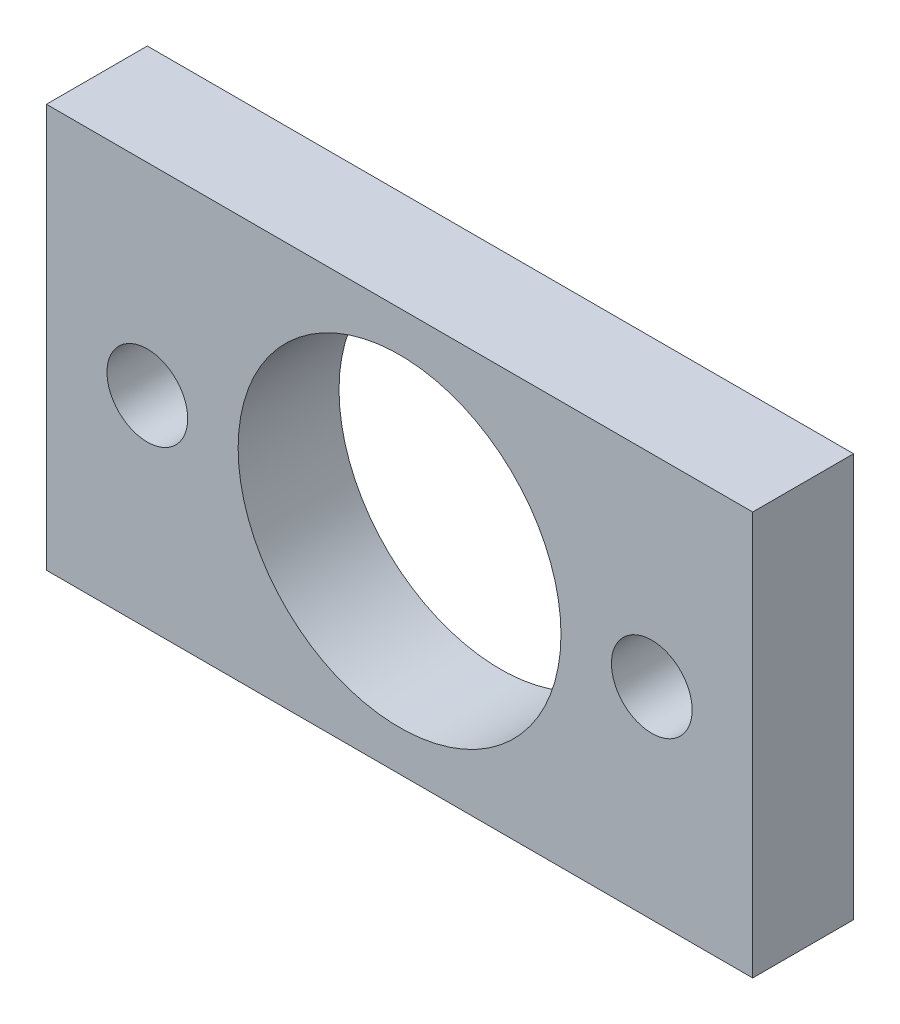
ISO-10303-21;
HEADER;
FILE_DESCRIPTION(('STEP AP214'),'2;1');
FILE_NAME('part.step','',(''),(''),'','','');
FILE_SCHEMA(('AUTOMOTIVE_DESIGN { 1 0 10303 214 1 1 1 1 }'));
ENDSEC;
DATA;
#1=APPLICATION_CONTEXT('core data for automotive mechanical design processes');
#2=APPLICATION_PROTOCOL_DEFINITION('international standard','automotive_design',2000,#1);
#3=PRODUCT_CONTEXT('',#1,'mechanical');
#4=PRODUCT('Part','Part','',(#3));
#5=PRODUCT_RELATED_PRODUCT_CATEGORY('part','',(#4));
#6=PRODUCT_DEFINITION_FORMATION('','',#4);
#7=PRODUCT_DEFINITION_CONTEXT('part definition',#1,'design');
#8=PRODUCT_DEFINITION('design','',#6,#7);
#9=PRODUCT_DEFINITION_SHAPE('','',#8);
#10=(LENGTH_UNIT() NAMED_UNIT(*) SI_UNIT(.MILLI.,.METRE.));
#11=(NAMED_UNIT(*) PLANE_ANGLE_UNIT() SI_UNIT($,.RADIAN.));
#12=(NAMED_UNIT(*) SI_UNIT($,.STERADIAN.) SOLID_ANGLE_UNIT());
#13=UNCERTAINTY_MEASURE_WITH_UNIT(LENGTH_MEASURE(1.E-05),#10,'distance_accuracy_value','');
#14=(GEOMETRIC_REPRESENTATION_CONTEXT(3) GLOBAL_UNCERTAINTY_ASSIGNED_CONTEXT((#13)) GLOBAL_UNIT_ASSIGNED_CONTEXT((#10,
#11,#12)) REPRESENTATION_CONTEXT('',''));
#15=CARTESIAN_POINT('',(0.,0.,0.));
#16=DIRECTION('',(0.,0.,1.));
#17=DIRECTION('',(1.,0.,0.));
#18=AXIS2_PLACEMENT_3D('',#15,#16,#17);
#19=CARTESIAN_POINT('',(-35.,-20.,10.));
#20=DIRECTION('',(0.,0.,1.));
#21=DIRECTION('',(1.,0.,0.));
#22=AXIS2_PLACEMENT_3D('',#19,#20,#21);
#23=PLANE('',#22);
#24=CARTESIAN_POINT('',(-25.,0.,10.));
#25=DIRECTION('',(0.,0.,1.));
#26=DIRECTION('',(1.,0.,0.));
#27=AXIS2_PLACEMENT_3D('',#24,#25,#26);
#28=CIRCLE('',#27,4.);
#29=CARTESIAN_POINT('',(-21.,0.,10.));
#30=VERTEX_POINT('',#29);
#31=EDGE_CURVE('E112',#30,#30,#28,.T.);
#32=ORIENTED_EDGE('',*,*,#31,.F.);
#33=EDGE_LOOP('',(#32));
#34=FACE_BOUND('',#33,.T.);
#35=DIRECTION('',(0.,-1.,0.));
#36=VECTOR('',#35,1.);
#37=CARTESIAN_POINT('',(-35.,20.,10.));
#38=LINE('',#37,#36);
#39=CARTESIAN_POINT('',(-35.,20.,10.));
#40=VERTEX_POINT('',#39);
#41=CARTESIAN_POINT('',(-35.,-20.,10.));
#42=VERTEX_POINT('',#41);
#43=EDGE_CURVE('E82',#40,#42,#38,.T.);
#44=ORIENTED_EDGE('',*,*,#43,.T.);
#45=DIRECTION('',(1.,0.,0.));
#46=VECTOR('',#45,1.);
#47=CARTESIAN_POINT('',(-35.,-20.,10.));
#48=LINE('',#47,#46);
#49=CARTESIAN_POINT('',(35.,-20.,10.));
#50=VERTEX_POINT('',#49);
#51=EDGE_CURVE('E77',#42,#50,#48,.T.);
#52=ORIENTED_EDGE('',*,*,#51,.T.);
#53=DIRECTION('',(0.,1.,0.));
#54=VECTOR('',#53,1.);
#55=CARTESIAN_POINT('',(35.,20.,10.));
#56=LINE('',#55,#54);
#57=CARTESIAN_POINT('',(35.,20.,10.));
#58=VERTEX_POINT('',#57);
#59=EDGE_CURVE('E80',#50,#58,#56,.T.);
#60=ORIENTED_EDGE('',*,*,#59,.T.);
#61=DIRECTION('',(-1.,0.,0.));
#62=VECTOR('',#61,1.);
#63=CARTESIAN_POINT('',(-35.,20.,10.));
#64=LINE('',#63,#62);
#65=EDGE_CURVE('E47',#58,#40,#64,.T.);
#66=ORIENTED_EDGE('',*,*,#65,.T.);
#67=EDGE_LOOP('',(#44,#52,#60,#66));
#68=FACE_BOUND('',#67,.T.);
#69=CARTESIAN_POINT('',(0.,0.,10.));
#70=DIRECTION('',(0.,0.,1.));
#71=DIRECTION('',(1.,0.,0.));
#72=AXIS2_PLACEMENT_3D('',#69,#70,#71);
#73=CIRCLE('',#72,16.);
#74=CARTESIAN_POINT('',(16.,0.,10.));
#75=VERTEX_POINT('',#74);
#76=EDGE_CURVE('E97',#75,#75,#73,.T.);
#77=ORIENTED_EDGE('',*,*,#76,.F.);
#78=EDGE_LOOP('',(#77));
#79=FACE_BOUND('',#78,.T.);
#80=CARTESIAN_POINT('',(25.,0.,10.));
#81=DIRECTION('',(0.,0.,1.));
#82=DIRECTION('',(1.,0.,0.));
#83=AXIS2_PLACEMENT_3D('',#80,#81,#82);
#84=CIRCLE('',#83,4.);
#85=CARTESIAN_POINT('',(29.,0.,10.));
#86=VERTEX_POINT('',#85);
#87=EDGE_CURVE('E118',#86,#86,#84,.T.);
#88=ORIENTED_EDGE('',*,*,#87,.F.);
#89=EDGE_LOOP('',(#88));
#90=FACE_BOUND('',#89,.T.);
#91=ADVANCED_FACE('F30',(#34,#68,#79,#90),#23,.T.);
#92=CARTESIAN_POINT('',(-35.,-20.,0.));
#93=DIRECTION('',(0.,0.,1.));
#94=DIRECTION('',(1.,0.,0.));
#95=AXIS2_PLACEMENT_3D('',#92,#93,#94);
#96=PLANE('',#95);
#97=CARTESIAN_POINT('',(-25.,0.,0.));
#98=DIRECTION('',(0.,0.,1.));
#99=DIRECTION('',(1.,0.,0.));
#100=AXIS2_PLACEMENT_3D('',#97,#98,#99);
#101=CIRCLE('',#100,4.);
#102=CARTESIAN_POINT('',(-21.,0.,0.));
#103=VERTEX_POINT('',#102);
#104=EDGE_CURVE('E115',#103,#103,#101,.T.);
#105=ORIENTED_EDGE('',*,*,#104,.T.);
#106=EDGE_LOOP('',(#105));
#107=FACE_BOUND('',#106,.T.);
#108=DIRECTION('',(0.,-1.,0.));
#109=VECTOR('',#108,1.);
#110=CARTESIAN_POINT('',(-35.,20.,0.));
#111=LINE('',#110,#109);
#112=CARTESIAN_POINT('',(-35.,20.,0.));
#113=VERTEX_POINT('',#112);
#114=CARTESIAN_POINT('',(-35.,-20.,0.));
#115=VERTEX_POINT('',#114);
#116=EDGE_CURVE('E94',#113,#115,#111,.T.);
#117=ORIENTED_EDGE('',*,*,#116,.F.);
#118=DIRECTION('',(-1.,0.,0.));
#119=VECTOR('',#118,1.);
#120=CARTESIAN_POINT('',(-35.,20.,0.));
#121=LINE('',#120,#119);
#122=CARTESIAN_POINT('',(35.,20.,0.));
#123=VERTEX_POINT('',#122);
#124=EDGE_CURVE('E70',#123,#113,#121,.T.);
#125=ORIENTED_EDGE('',*,*,#124,.F.);
#126=DIRECTION('',(0.,1.,0.));
#127=VECTOR('',#126,1.);
#128=CARTESIAN_POINT('',(35.,20.,0.));
#129=LINE('',#128,#127);
#130=CARTESIAN_POINT('',(35.,-20.,0.));
#131=VERTEX_POINT('',#130);
#132=EDGE_CURVE('E64',#131,#123,#129,.T.);
#133=ORIENTED_EDGE('',*,*,#132,.F.);
#134=DIRECTION('',(1.,0.,0.));
#135=VECTOR('',#134,1.);
#136=CARTESIAN_POINT('',(-35.,-20.,0.));
#137=LINE('',#136,#135);
#138=EDGE_CURVE('E86',#115,#131,#137,.T.);
#139=ORIENTED_EDGE('',*,*,#138,.F.);
#140=EDGE_LOOP('',(#117,#125,#133,#139));
#141=FACE_BOUND('',#140,.T.);
#142=CARTESIAN_POINT('',(0.,0.,0.));
#143=DIRECTION('',(0.,0.,1.));
#144=DIRECTION('',(1.,0.,0.));
#145=AXIS2_PLACEMENT_3D('',#142,#143,#144);
#146=CIRCLE('',#145,16.);
#147=CARTESIAN_POINT('',(16.,0.,0.));
#148=VERTEX_POINT('',#147);
#149=EDGE_CURVE('E109',#148,#148,#146,.T.);
#150=ORIENTED_EDGE('',*,*,#149,.T.);
#151=EDGE_LOOP('',(#150));
#152=FACE_BOUND('',#151,.T.);
#153=CARTESIAN_POINT('',(25.,0.,0.));
#154=DIRECTION('',(0.,0.,1.));
#155=DIRECTION('',(1.,0.,0.));
#156=AXIS2_PLACEMENT_3D('',#153,#154,#155);
#157=CIRCLE('',#156,4.);
#158=CARTESIAN_POINT('',(29.,0.,0.));
#159=VERTEX_POINT('',#158);
#160=EDGE_CURVE('E121',#159,#159,#157,.T.);
#161=ORIENTED_EDGE('',*,*,#160,.T.);
#162=EDGE_LOOP('',(#161));
#163=FACE_BOUND('',#162,.T.);
#164=ADVANCED_FACE('F105',(#107,#141,#152,#163),#96,.F.);
#165=CARTESIAN_POINT('',(-35.,20.,10.));
#166=DIRECTION('',(1.,0.,0.));
#167=DIRECTION('',(0.,1.,0.));
#168=AXIS2_PLACEMENT_3D('',#165,#166,#167);
#169=PLANE('',#168);
#170=ORIENTED_EDGE('',*,*,#116,.T.);
#171=DIRECTION('',(0.,0.,-1.));
#172=VECTOR('',#171,1.);
#173=CARTESIAN_POINT('',(-35.,-20.,10.));
#174=LINE('',#173,#172);
#175=EDGE_CURVE('E11',#42,#115,#174,.T.);
#176=ORIENTED_EDGE('',*,*,#175,.F.);
#177=ORIENTED_EDGE('',*,*,#43,.F.);
#178=DIRECTION('',(0.,0.,-1.));
#179=VECTOR('',#178,1.);
#180=CARTESIAN_POINT('',(-35.,20.,10.));
#181=LINE('',#180,#179);
#182=EDGE_CURVE('E90',#40,#113,#181,.T.);
#183=ORIENTED_EDGE('',*,*,#182,.T.);
#184=EDGE_LOOP('',(#170,#176,#177,#183));
#185=FACE_BOUND('',#184,.T.);
#186=ADVANCED_FACE('F32',(#185),#169,.F.);
#187=CARTESIAN_POINT('',(-35.,-20.,10.));
#188=DIRECTION('',(0.,1.,0.));
#189=DIRECTION('',(0.,0.,1.));
#190=AXIS2_PLACEMENT_3D('',#187,#188,#189);
#191=PLANE('',#190);
#192=ORIENTED_EDGE('',*,*,#138,.T.);
#193=DIRECTION('',(0.,0.,-1.));
#194=VECTOR('',#193,1.);
#195=CARTESIAN_POINT('',(35.,-20.,10.));
#196=LINE('',#195,#194);
#197=EDGE_CURVE('E39',#50,#131,#196,.T.);
#198=ORIENTED_EDGE('',*,*,#197,.F.);
#199=ORIENTED_EDGE('',*,*,#51,.F.);
#200=ORIENTED_EDGE('',*,*,#175,.T.);
#201=EDGE_LOOP('',(#192,#198,#199,#200));
#202=FACE_BOUND('',#201,.T.);
#203=ADVANCED_FACE('F85',(#202),#191,.F.);
#204=CARTESIAN_POINT('',(35.,20.,10.));
#205=DIRECTION('',(-1.,0.,0.));
#206=DIRECTION('',(0.,-1.,0.));
#207=AXIS2_PLACEMENT_3D('',#204,#205,#206);
#208=PLANE('',#207);
#209=ORIENTED_EDGE('',*,*,#132,.T.);
#210=DIRECTION('',(0.,0.,-1.));
#211=VECTOR('',#210,1.);
#212=CARTESIAN_POINT('',(35.,20.,10.));
#213=LINE('',#212,#211);
#214=EDGE_CURVE('E87',#58,#123,#213,.T.);
#215=ORIENTED_EDGE('',*,*,#214,.F.);
#216=ORIENTED_EDGE('',*,*,#59,.F.);
#217=ORIENTED_EDGE('',*,*,#197,.T.);
#218=EDGE_LOOP('',(#209,#215,#216,#217));
#219=FACE_BOUND('',#218,.T.);
#220=ADVANCED_FACE('F88',(#219),#208,.F.);
#221=CARTESIAN_POINT('',(-35.,20.,10.));
#222=DIRECTION('',(0.,-1.,0.));
#223=DIRECTION('',(0.,0.,-1.));
#224=AXIS2_PLACEMENT_3D('',#221,#222,#223);
#225=PLANE('',#224);
#226=ORIENTED_EDGE('',*,*,#124,.T.);
#227=ORIENTED_EDGE('',*,*,#182,.F.);
#228=ORIENTED_EDGE('',*,*,#65,.F.);
#229=ORIENTED_EDGE('',*,*,#214,.T.);
#230=EDGE_LOOP('',(#226,#227,#228,#229));
#231=FACE_BOUND('',#230,.T.);
#232=ADVANCED_FACE('F102',(#231),#225,.F.);
#233=CARTESIAN_POINT('',(0.,0.,10.));
#234=DIRECTION('',(0.,0.,-1.));
#235=DIRECTION('',(-1.,0.,0.));
#236=AXIS2_PLACEMENT_3D('',#233,#234,#235);
#237=CYLINDRICAL_SURFACE('',#236,16.);
#238=ORIENTED_EDGE('',*,*,#76,.T.);
#239=EDGE_LOOP('',(#238));
#240=FACE_BOUND('',#239,.T.);
#241=ORIENTED_EDGE('',*,*,#149,.F.);
#242=EDGE_LOOP('',(#241));
#243=FACE_BOUND('',#242,.T.);
#244=ADVANCED_FACE('F140',(#240,#243),#237,.F.);
#245=CARTESIAN_POINT('',(-25.,0.,10.));
#246=DIRECTION('',(0.,0.,-1.));
#247=DIRECTION('',(-1.,0.,0.));
#248=AXIS2_PLACEMENT_3D('',#245,#246,#247);
#249=CYLINDRICAL_SURFACE('',#248,4.);
#250=ORIENTED_EDGE('',*,*,#31,.T.);
#251=EDGE_LOOP('',(#250));
#252=FACE_BOUND('',#251,.T.);
#253=ORIENTED_EDGE('',*,*,#104,.F.);
#254=EDGE_LOOP('',(#253));
#255=FACE_BOUND('',#254,.T.);
#256=ADVANCED_FACE('F186',(#252,#255),#249,.F.);
#257=CARTESIAN_POINT('',(25.,0.,10.));
#258=DIRECTION('',(0.,0.,-1.));
#259=DIRECTION('',(-1.,0.,0.));
#260=AXIS2_PLACEMENT_3D('',#257,#258,#259);
#261=CYLINDRICAL_SURFACE('',#260,4.);
#262=ORIENTED_EDGE('',*,*,#87,.T.);
#263=EDGE_LOOP('',(#262));
#264=FACE_BOUND('',#263,.T.);
#265=ORIENTED_EDGE('',*,*,#160,.F.);
#266=EDGE_LOOP('',(#265));
#267=FACE_BOUND('',#266,.T.);
#268=ADVANCED_FACE('F127',(#264,#267),#261,.F.);
#269=CLOSED_SHELL('',(#91,#164,#186,#203,#220,#232,#244,#256,#268));
#270=MANIFOLD_SOLID_BREP('B2',#269);
#271=ADVANCED_BREP_SHAPE_REPRESENTATION('',(#18,#270),#14);
#272=SHAPE_DEFINITION_REPRESENTATION(#9,#271);
ENDSEC;
END-ISO-10303-21;
